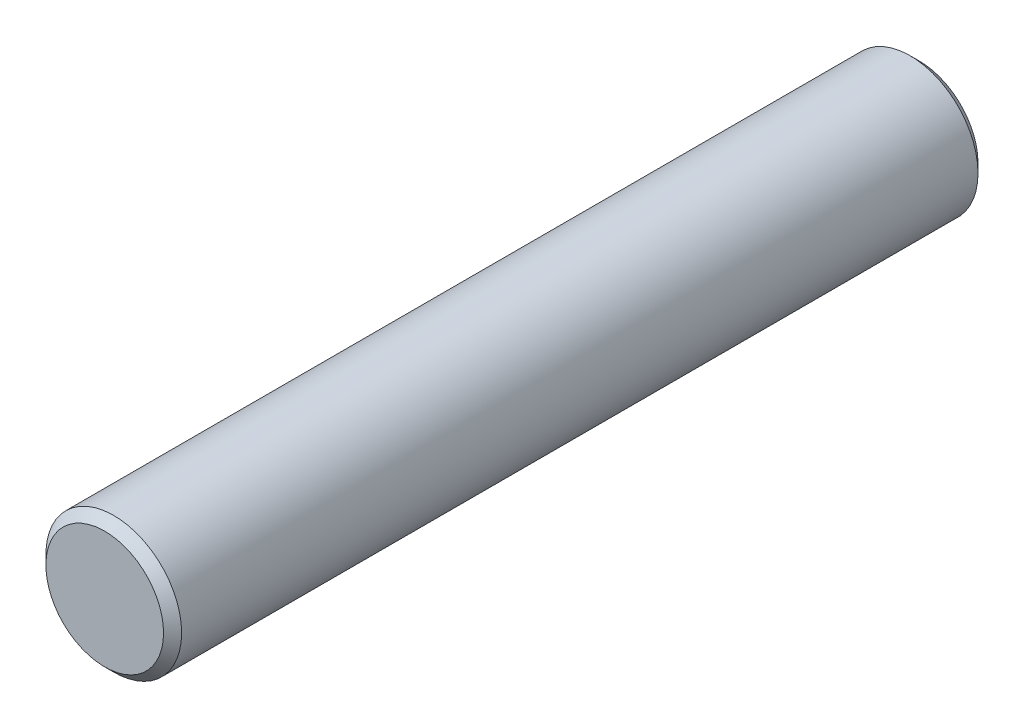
from build123d import *

# Parameters (mm, degrees)
ESQUISSE1_R      = 1.5
EXTRUSION1_DEPTH = 18
CHANFREIN1_SIZE  = 0.2


with BuildPart() as part:
    # Esquisse1 → Extrusion1 (new body)
    with BuildSketch(Plane.XY):
        Circle(ESQUISSE1_R)
    extrude(amount=-EXTRUSION1_DEPTH)

    # Chanfrein1
    chanfrein1_edges = [part.edges().sort_by_distance(p)[0] for p in [
        (-1.5, 0, 0),
        (-1.5, 0, -18),
    ]]
    chamfer(chanfrein1_edges, length=CHANFREIN1_SIZE)


solid = part.part
